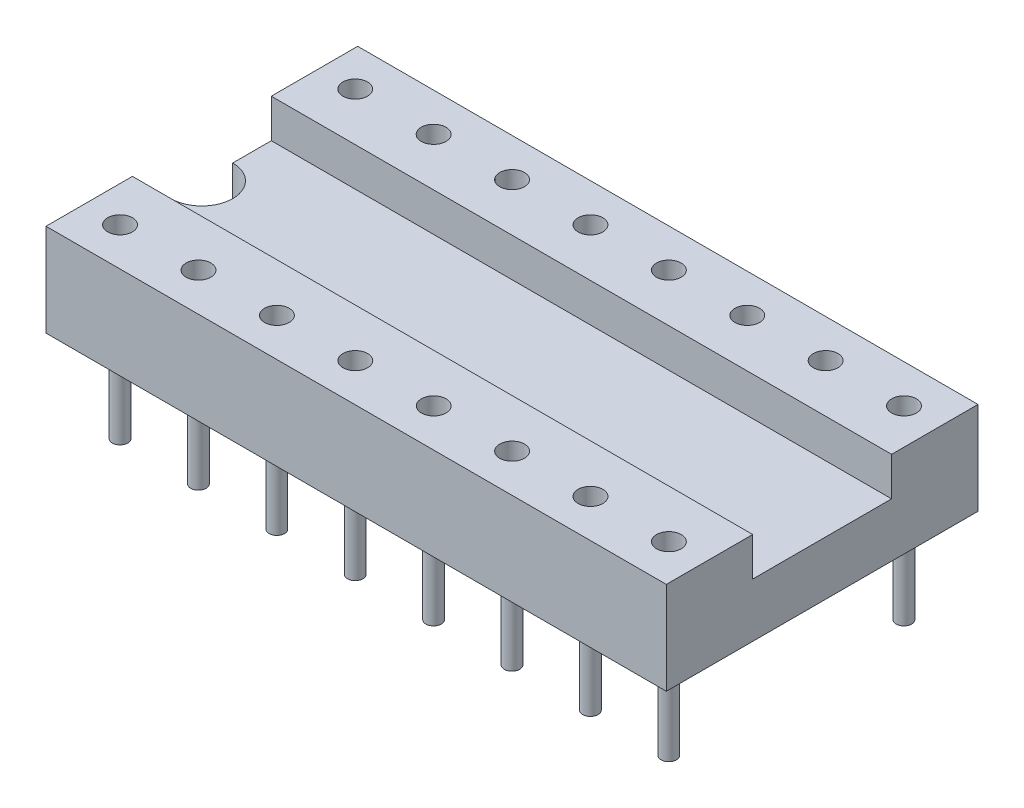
from build123d import *

# Parameters (mm, degrees)
EXTRUSION1_DEPTH        = 20.1
ENL_V_MAT_EXTRU_1_DEPTH = 21.798437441
ESQUISSE3_R             = 0.4
ENL_V_MAT_EXTRU_2_DEPTH = 2.5
ESQUISSE5_R             = 0.25
EXTRUSION2_DEPTH        = 3


with BuildPart() as part:
    # Esquisse1 → Extrusion1 (new body)
    with BuildSketch(Plane(origin=(0, 0, 0), x_dir=(0, 0, -1), z_dir=(1, 0, 0))):
        Polygon((-2.25, 1.75), (-2.25, 3), (-5.05, 3), (-5.05, 0), (5.05, 0), (5.05, 3), (2.25, 3), (2.25, 1.75), align=None)
    extrude(amount=EXTRUSION1_DEPTH)

    # Esquisse2 → Enl_v. mat.-Extru.1 (cut, through all)
    with BuildSketch(Plane(origin=(0, 1.75, 0), x_dir=(-1, 0, 0), z_dir=(0, 1, 0))):
        with BuildLine():
            Line((0, -1), (0, 1))
            ThreePointArc((0, 1), (-1, 0), (0, -1))
        make_face()
    extrude(amount=-ENL_V_MAT_EXTRU_1_DEPTH, mode=Mode.SUBTRACT)

    # Esquisse3 → Enl_v. mat.-Extru.2 (cut)
    with BuildSketch(Plane(origin=(0, 3, 0), x_dir=(-1, 0, 0), z_dir=(0, 1, 0))):
        with Locations(Location((-1.16, 3.81, 0), (0, 0, 90))):
            Circle(ESQUISSE3_R)
        with Locations(Location((-1.16, -3.81, 0), (0, 0, 270))):
            Circle(ESQUISSE3_R)
        with Locations(Location((-3.701, 3.81, 0), (0, 0, 90))):
            Circle(ESQUISSE3_R)
        with Locations(Location((-3.701, -3.81, 0), (0, 0, 270))):
            Circle(ESQUISSE3_R)
        with Locations(Location((-6.242, 3.81, 0), (0, 0, 90))):
            Circle(ESQUISSE3_R)
        with Locations(Location((-6.242, -3.81, 0), (0, 0, 270))):
            Circle(ESQUISSE3_R)
        with Locations(Location((-8.783, 3.81, 0), (0, 0, 90))):
            Circle(ESQUISSE3_R)
        with Locations(Location((-8.783, -3.81, 0), (0, 0, 270))):
            Circle(ESQUISSE3_R)
        with Locations(Location((-11.323, 3.81, 0), (0, 0, 90))):
            Circle(ESQUISSE3_R)
        with Locations(Location((-11.323, -3.81, 0), (0, 0, 270))):
            Circle(ESQUISSE3_R)
        with Locations(Location((-13.863, 3.81, 0), (0, 0, 90))):
            Circle(ESQUISSE3_R)
        with Locations(Location((-13.863, -3.81, 0), (0, 0, 270))):
            Circle(ESQUISSE3_R)
        with Locations(Location((-16.403, 3.81, 0), (0, 0, 90))):
            Circle(ESQUISSE3_R)
        with Locations(Location((-16.403, -3.81, 0), (0, 0, 270))):
            Circle(ESQUISSE3_R)
        with Locations(Location((-18.943, 3.81, 0), (0, 0, 90))):
            Circle(ESQUISSE3_R)
        with Locations(Location((-18.943, -3.81, 0), (0, 0, 270))):
            Circle(ESQUISSE3_R)
    extrude(amount=-ENL_V_MAT_EXTRU_2_DEPTH, mode=Mode.SUBTRACT)

    # Esquisse5 → Extrusion2 (add)
    with BuildSketch(Plane.XZ):
        with Locations(Location((1.16, 3.81, 0), (0, 0, 90))):
            Circle(ESQUISSE5_R)
        with Locations(Location((1.16, -3.81, 0), (0, 0, 90))):
            Circle(ESQUISSE5_R)
        with Locations(Location((3.7, -3.81, 0), (0, 0, 90))):
            Circle(ESQUISSE5_R)
        with Locations(Location((3.7, 3.81, 0), (0, 0, 90))):
            Circle(ESQUISSE5_R)
        with Locations(Location((6.24, -3.81, 0), (0, 0, 90))):
            Circle(ESQUISSE5_R)
        with Locations(Location((6.24, 3.81, 0), (0, 0, 90))):
            Circle(ESQUISSE5_R)
        with Locations(Location((8.78, -3.81, 0), (0, 0, 90))):
            Circle(ESQUISSE5_R)
        with Locations(Location((8.78, 3.81, 0), (0, 0, 90))):
            Circle(ESQUISSE5_R)
        with Locations(Location((11.32, -3.81, 0), (0, 0, 90))):
            Circle(ESQUISSE5_R)
        with Locations(Location((11.32, 3.81, 0), (0, 0, 90))):
            Circle(ESQUISSE5_R)
        with Locations(Location((13.86, -3.81, 0), (0, 0, 90))):
            Circle(ESQUISSE5_R)
        with Locations(Location((13.86, 3.81, 0), (0, 0, 90))):
            Circle(ESQUISSE5_R)
        with Locations(Location((16.4, -3.81, 0), (0, 0, 90))):
            Circle(ESQUISSE5_R)
        with Locations(Location((16.4, 3.81, 0), (0, 0, 90))):
            Circle(ESQUISSE5_R)
        with Locations(Location((18.94, -3.81, 0), (0, 0, 90))):
            Circle(ESQUISSE5_R)
        with Locations(Location((18.94, 3.81, 0), (0, 0, 90))):
            Circle(ESQUISSE5_R)
    extrude(amount=EXTRUSION2_DEPTH)


solid = part.part
